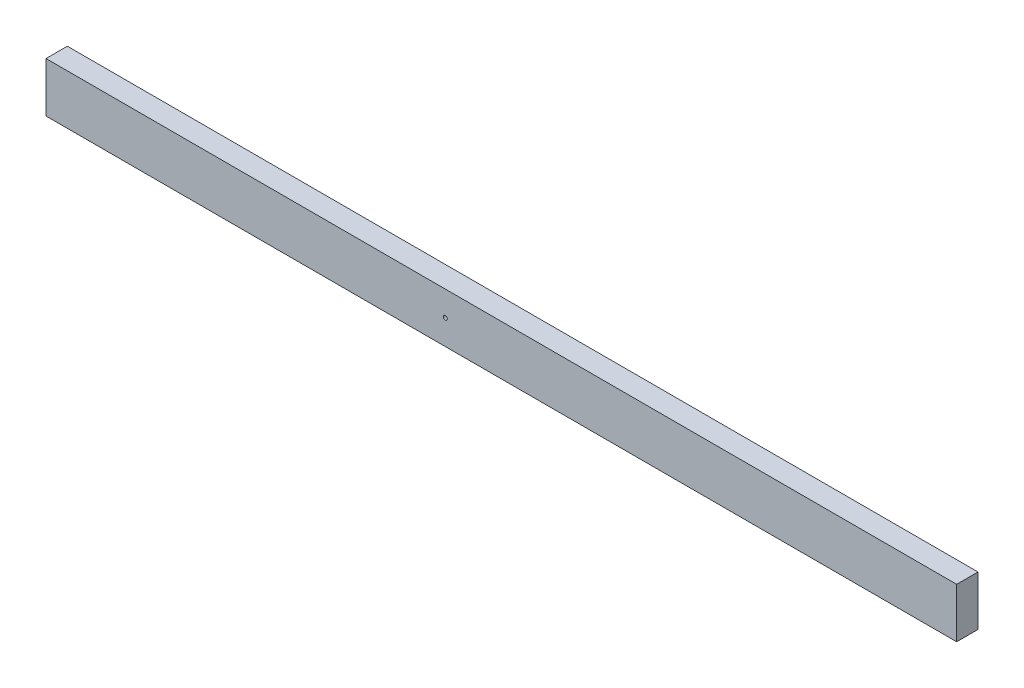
ISO-10303-21;
HEADER;
FILE_DESCRIPTION(('STEP AP214'),'2;1');
FILE_NAME('part.step','',(''),(''),'','','');
FILE_SCHEMA(('AUTOMOTIVE_DESIGN { 1 0 10303 214 1 1 1 1 }'));
ENDSEC;
DATA;
#1=APPLICATION_CONTEXT('core data for automotive mechanical design processes');
#2=APPLICATION_PROTOCOL_DEFINITION('international standard','automotive_design',2000,#1);
#3=PRODUCT_CONTEXT('',#1,'mechanical');
#4=PRODUCT('Part','Part','',(#3));
#5=PRODUCT_RELATED_PRODUCT_CATEGORY('part','',(#4));
#6=PRODUCT_DEFINITION_FORMATION('','',#4);
#7=PRODUCT_DEFINITION_CONTEXT('part definition',#1,'design');
#8=PRODUCT_DEFINITION('design','',#6,#7);
#9=PRODUCT_DEFINITION_SHAPE('','',#8);
#10=(LENGTH_UNIT() NAMED_UNIT(*) SI_UNIT(.MILLI.,.METRE.));
#11=(NAMED_UNIT(*) PLANE_ANGLE_UNIT() SI_UNIT($,.RADIAN.));
#12=(NAMED_UNIT(*) SI_UNIT($,.STERADIAN.) SOLID_ANGLE_UNIT());
#13=UNCERTAINTY_MEASURE_WITH_UNIT(LENGTH_MEASURE(1.E-05),#10,'distance_accuracy_value','');
#14=(GEOMETRIC_REPRESENTATION_CONTEXT(3) GLOBAL_UNCERTAINTY_ASSIGNED_CONTEXT((#13)) GLOBAL_UNIT_ASSIGNED_CONTEXT((#10,
#11,#12)) REPRESENTATION_CONTEXT('',''));
#15=CARTESIAN_POINT('',(0.,0.,0.));
#16=DIRECTION('',(0.,0.,1.));
#17=DIRECTION('',(1.,0.,0.));
#18=AXIS2_PLACEMENT_3D('',#15,#16,#17);
#19=CARTESIAN_POINT('',(1625.6,-44.45,-19.05));
#20=DIRECTION('',(0.,0.,1.));
#21=DIRECTION('',(1.,0.,0.));
#22=AXIS2_PLACEMENT_3D('',#19,#20,#21);
#23=PLANE('',#22);
#24=CARTESIAN_POINT('',(712.7875,0.,-19.05));
#25=DIRECTION('',(0.,0.,1.));
#26=DIRECTION('',(1.,0.,0.));
#27=AXIS2_PLACEMENT_3D('',#24,#25,#26);
#28=CIRCLE('',#27,3.571875);
#29=CARTESIAN_POINT('',(716.359375,0.,-19.05));
#30=VERTEX_POINT('',#29);
#31=EDGE_CURVE('E98',#30,#30,#28,.T.);
#32=ORIENTED_EDGE('',*,*,#31,.T.);
#33=EDGE_LOOP('',(#32));
#34=FACE_BOUND('',#33,.T.);
#35=DIRECTION('',(0.,1.,0.));
#36=VECTOR('',#35,1.);
#37=CARTESIAN_POINT('',(0.,-44.45,-19.05));
#38=LINE('',#37,#36);
#39=CARTESIAN_POINT('',(0.,-44.45,-19.05));
#40=VERTEX_POINT('',#39);
#41=CARTESIAN_POINT('',(0.,44.45,-19.05));
#42=VERTEX_POINT('',#41);
#43=EDGE_CURVE('E95',#40,#42,#38,.T.);
#44=ORIENTED_EDGE('',*,*,#43,.T.);
#45=DIRECTION('',(-1.,0.,0.));
#46=VECTOR('',#45,1.);
#47=CARTESIAN_POINT('',(1625.6,44.45,-19.05));
#48=LINE('',#47,#46);
#49=CARTESIAN_POINT('',(1625.6,44.45,-19.05));
#50=VERTEX_POINT('',#49);
#51=EDGE_CURVE('E11',#50,#42,#48,.T.);
#52=ORIENTED_EDGE('',*,*,#51,.F.);
#53=DIRECTION('',(0.,1.,0.));
#54=VECTOR('',#53,1.);
#55=CARTESIAN_POINT('',(1625.6,-44.45,-19.05));
#56=LINE('',#55,#54);
#57=CARTESIAN_POINT('',(1625.6,-44.45,-19.05));
#58=VERTEX_POINT('',#57);
#59=EDGE_CURVE('E83',#58,#50,#56,.T.);
#60=ORIENTED_EDGE('',*,*,#59,.F.);
#61=DIRECTION('',(-1.,0.,0.));
#62=VECTOR('',#61,1.);
#63=CARTESIAN_POINT('',(1625.6,-44.45,-19.05));
#64=LINE('',#63,#62);
#65=EDGE_CURVE('E91',#58,#40,#64,.T.);
#66=ORIENTED_EDGE('',*,*,#65,.T.);
#67=EDGE_LOOP('',(#44,#52,#60,#66));
#68=FACE_BOUND('',#67,.T.);
#69=ADVANCED_FACE('F32',(#34,#68),#23,.F.);
#70=CARTESIAN_POINT('',(1625.6,44.45,19.05));
#71=DIRECTION('',(0.,-1.,0.));
#72=DIRECTION('',(0.,0.,-1.));
#73=AXIS2_PLACEMENT_3D('',#70,#71,#72);
#74=PLANE('',#73);
#75=DIRECTION('',(0.,0.,1.));
#76=VECTOR('',#75,1.);
#77=CARTESIAN_POINT('',(0.,44.45,19.05));
#78=LINE('',#77,#76);
#79=CARTESIAN_POINT('',(0.,44.45,19.05));
#80=VERTEX_POINT('',#79);
#81=EDGE_CURVE('E87',#42,#80,#78,.T.);
#82=ORIENTED_EDGE('',*,*,#81,.T.);
#83=DIRECTION('',(-1.,0.,0.));
#84=VECTOR('',#83,1.);
#85=CARTESIAN_POINT('',(1625.6,44.45,19.05));
#86=LINE('',#85,#84);
#87=CARTESIAN_POINT('',(1625.6,44.45,19.05));
#88=VERTEX_POINT('',#87);
#89=EDGE_CURVE('E40',#88,#80,#86,.T.);
#90=ORIENTED_EDGE('',*,*,#89,.F.);
#91=DIRECTION('',(0.,0.,1.));
#92=VECTOR('',#91,1.);
#93=CARTESIAN_POINT('',(1625.6,44.45,19.05));
#94=LINE('',#93,#92);
#95=EDGE_CURVE('E78',#50,#88,#94,.T.);
#96=ORIENTED_EDGE('',*,*,#95,.F.);
#97=ORIENTED_EDGE('',*,*,#51,.T.);
#98=EDGE_LOOP('',(#82,#90,#96,#97));
#99=FACE_BOUND('',#98,.T.);
#100=ADVANCED_FACE('F86',(#99),#74,.F.);
#101=CARTESIAN_POINT('',(1625.6,-44.45,19.05));
#102=DIRECTION('',(0.,0.,-1.));
#103=DIRECTION('',(-1.,0.,0.));
#104=AXIS2_PLACEMENT_3D('',#101,#102,#103);
#105=PLANE('',#104);
#106=CARTESIAN_POINT('',(712.7875,0.,19.05));
#107=DIRECTION('',(0.,0.,1.));
#108=DIRECTION('',(1.,0.,0.));
#109=AXIS2_PLACEMENT_3D('',#106,#107,#108);
#110=CIRCLE('',#109,3.571875);
#111=CARTESIAN_POINT('',(716.359375,0.,19.05));
#112=VERTEX_POINT('',#111);
#113=EDGE_CURVE('E111',#112,#112,#110,.T.);
#114=ORIENTED_EDGE('',*,*,#113,.F.);
#115=EDGE_LOOP('',(#114));
#116=FACE_BOUND('',#115,.T.);
#117=DIRECTION('',(0.,-1.,0.));
#118=VECTOR('',#117,1.);
#119=CARTESIAN_POINT('',(0.,-44.45,19.05));
#120=LINE('',#119,#118);
#121=CARTESIAN_POINT('',(0.,-44.45,19.05));
#122=VERTEX_POINT('',#121);
#123=EDGE_CURVE('E65',#80,#122,#120,.T.);
#124=ORIENTED_EDGE('',*,*,#123,.T.);
#125=DIRECTION('',(-1.,0.,0.));
#126=VECTOR('',#125,1.);
#127=CARTESIAN_POINT('',(1625.6,-44.45,19.05));
#128=LINE('',#127,#126);
#129=CARTESIAN_POINT('',(1625.6,-44.45,19.05));
#130=VERTEX_POINT('',#129);
#131=EDGE_CURVE('E88',#130,#122,#128,.T.);
#132=ORIENTED_EDGE('',*,*,#131,.F.);
#133=DIRECTION('',(0.,-1.,0.));
#134=VECTOR('',#133,1.);
#135=CARTESIAN_POINT('',(1625.6,-44.45,19.05));
#136=LINE('',#135,#134);
#137=EDGE_CURVE('E81',#88,#130,#136,.T.);
#138=ORIENTED_EDGE('',*,*,#137,.F.);
#139=ORIENTED_EDGE('',*,*,#89,.T.);
#140=EDGE_LOOP('',(#124,#132,#138,#139));
#141=FACE_BOUND('',#140,.T.);
#142=ADVANCED_FACE('F89',(#116,#141),#105,.F.);
#143=CARTESIAN_POINT('',(1625.6,-44.45,19.05));
#144=DIRECTION('',(0.,1.,0.));
#145=DIRECTION('',(0.,0.,1.));
#146=AXIS2_PLACEMENT_3D('',#143,#144,#145);
#147=PLANE('',#146);
#148=DIRECTION('',(0.,0.,-1.));
#149=VECTOR('',#148,1.);
#150=CARTESIAN_POINT('',(0.,-44.45,19.05));
#151=LINE('',#150,#149);
#152=EDGE_CURVE('E71',#122,#40,#151,.T.);
#153=ORIENTED_EDGE('',*,*,#152,.T.);
#154=ORIENTED_EDGE('',*,*,#65,.F.);
#155=DIRECTION('',(0.,0.,-1.));
#156=VECTOR('',#155,1.);
#157=CARTESIAN_POINT('',(1625.6,-44.45,19.05));
#158=LINE('',#157,#156);
#159=EDGE_CURVE('E48',#130,#58,#158,.T.);
#160=ORIENTED_EDGE('',*,*,#159,.F.);
#161=ORIENTED_EDGE('',*,*,#131,.T.);
#162=EDGE_LOOP('',(#153,#154,#160,#161));
#163=FACE_BOUND('',#162,.T.);
#164=ADVANCED_FACE('F103',(#163),#147,.F.);
#165=CARTESIAN_POINT('',(1625.6,0.,0.));
#166=DIRECTION('',(-1.,0.,0.));
#167=DIRECTION('',(0.,0.,1.));
#168=AXIS2_PLACEMENT_3D('',#165,#166,#167);
#169=PLANE('',#168);
#170=ORIENTED_EDGE('',*,*,#59,.T.);
#171=ORIENTED_EDGE('',*,*,#95,.T.);
#172=ORIENTED_EDGE('',*,*,#137,.T.);
#173=ORIENTED_EDGE('',*,*,#159,.T.);
#174=EDGE_LOOP('',(#170,#171,#172,#173));
#175=FACE_BOUND('',#174,.T.);
#176=ADVANCED_FACE('F79',(#175),#169,.F.);
#177=CARTESIAN_POINT('',(0.,0.,0.));
#178=DIRECTION('',(-1.,0.,0.));
#179=DIRECTION('',(0.,0.,1.));
#180=AXIS2_PLACEMENT_3D('',#177,#178,#179);
#181=PLANE('',#180);
#182=ORIENTED_EDGE('',*,*,#43,.F.);
#183=ORIENTED_EDGE('',*,*,#152,.F.);
#184=ORIENTED_EDGE('',*,*,#123,.F.);
#185=ORIENTED_EDGE('',*,*,#81,.F.);
#186=EDGE_LOOP('',(#182,#183,#184,#185));
#187=FACE_BOUND('',#186,.T.);
#188=ADVANCED_FACE('F106',(#187),#181,.T.);
#189=CARTESIAN_POINT('',(712.7875,0.,19.05));
#190=DIRECTION('',(0.,0.,1.));
#191=DIRECTION('',(1.,0.,0.));
#192=AXIS2_PLACEMENT_3D('',#189,#190,#191);
#193=CYLINDRICAL_SURFACE('',#192,3.571875);
#194=ORIENTED_EDGE('',*,*,#31,.F.);
#195=EDGE_LOOP('',(#194));
#196=FACE_BOUND('',#195,.T.);
#197=ORIENTED_EDGE('',*,*,#113,.T.);
#198=EDGE_LOOP('',(#197));
#199=FACE_BOUND('',#198,.T.);
#200=ADVANCED_FACE('F115',(#196,#199),#193,.F.);
#201=CLOSED_SHELL('',(#69,#100,#142,#164,#176,#188,#200));
#202=MANIFOLD_SOLID_BREP('B2',#201);
#203=ADVANCED_BREP_SHAPE_REPRESENTATION('',(#18,#202),#14);
#204=SHAPE_DEFINITION_REPRESENTATION(#9,#203);
ENDSEC;
END-ISO-10303-21;
